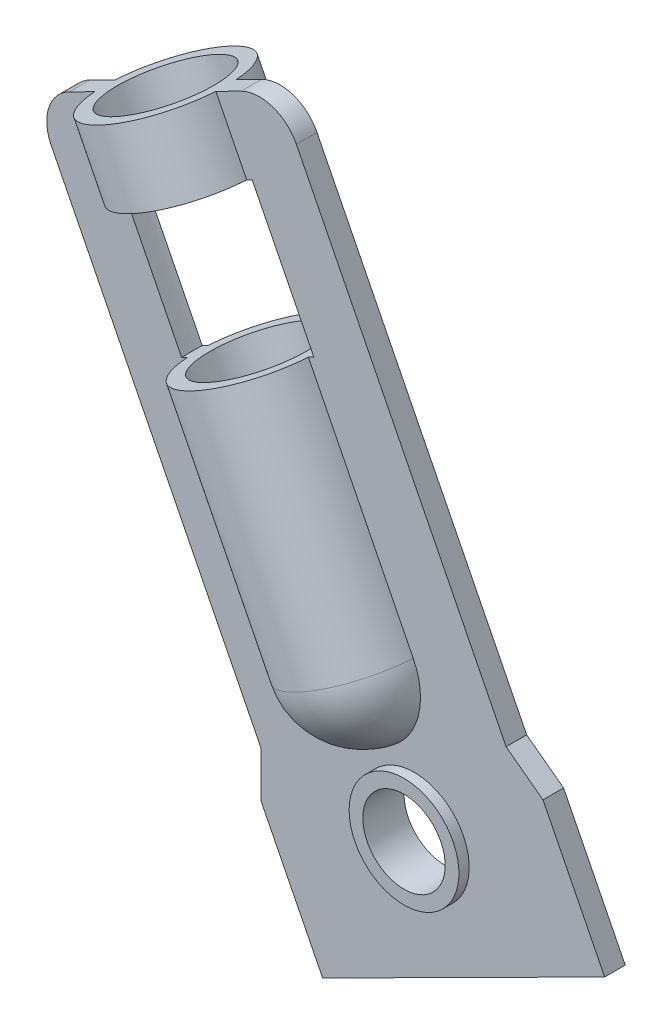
ISO-10303-21;
HEADER;
FILE_DESCRIPTION(('STEP AP214'),'2;1');
FILE_NAME('part.step','',(''),(''),'','','');
FILE_SCHEMA(('AUTOMOTIVE_DESIGN { 1 0 10303 214 1 1 1 1 }'));
ENDSEC;
DATA;
#1=APPLICATION_CONTEXT('core data for automotive mechanical design processes');
#2=APPLICATION_PROTOCOL_DEFINITION('international standard','automotive_design',2000,#1);
#3=PRODUCT_CONTEXT('',#1,'mechanical');
#4=PRODUCT('Part','Part','',(#3));
#5=PRODUCT_RELATED_PRODUCT_CATEGORY('part','',(#4));
#6=PRODUCT_DEFINITION_FORMATION('','',#4);
#7=PRODUCT_DEFINITION_CONTEXT('part definition',#1,'design');
#8=PRODUCT_DEFINITION('design','',#6,#7);
#9=PRODUCT_DEFINITION_SHAPE('','',#8);
#10=(LENGTH_UNIT() NAMED_UNIT(*) SI_UNIT(.MILLI.,.METRE.));
#11=(NAMED_UNIT(*) PLANE_ANGLE_UNIT() SI_UNIT($,.RADIAN.));
#12=(NAMED_UNIT(*) SI_UNIT($,.STERADIAN.) SOLID_ANGLE_UNIT());
#13=UNCERTAINTY_MEASURE_WITH_UNIT(LENGTH_MEASURE(1.E-05),#10,'distance_accuracy_value','');
#14=(GEOMETRIC_REPRESENTATION_CONTEXT(3) GLOBAL_UNCERTAINTY_ASSIGNED_CONTEXT((#13)) GLOBAL_UNIT_ASSIGNED_CONTEXT((#10,
#11,#12)) REPRESENTATION_CONTEXT('',''));
#15=CARTESIAN_POINT('',(0.,0.,0.));
#16=DIRECTION('',(0.,0.,1.));
#17=DIRECTION('',(1.,0.,0.));
#18=AXIS2_PLACEMENT_3D('',#15,#16,#17);
#19=CARTESIAN_POINT('',(18.8737568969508,39.4482201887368,18.5));
#20=DIRECTION('',(0.449375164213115,-0.893343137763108,0.));
#21=DIRECTION('',(0.893343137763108,0.449375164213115,0.));
#22=AXIS2_PLACEMENT_3D('',#19,#20,#21);
#23=CYLINDRICAL_SURFACE('',#22,5.);
#24=CARTESIAN_POINT('',(6.74062746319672,63.5684849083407,18.5));
#25=DIRECTION('',(0.449375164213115,-0.893343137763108,0.));
#26=DIRECTION('',(0.893343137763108,0.449375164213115,0.));
#27=AXIS2_PLACEMENT_3D('',#24,#25,#26);
#28=CIRCLE('',#27,5.);
#29=CARTESIAN_POINT('',(11.1568067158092,65.7899395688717,17.75));
#30=VERTEX_POINT('',#29);
#31=CARTESIAN_POINT('',(2.32444821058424,61.3470302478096,17.75));
#32=VERTEX_POINT('',#31);
#33=EDGE_CURVE('E718',#30,#32,#28,.F.);
#34=ORIENTED_EDGE('',*,*,#33,.F.);
#35=DIRECTION('',(0.449375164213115,-0.893343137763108,0.));
#36=VECTOR('',#35,1.);
#37=CARTESIAN_POINT('',(23.2899361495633,41.6696748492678,17.75));
#38=LINE('',#37,#36);
#39=CARTESIAN_POINT('',(18.7961845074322,50.6031062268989,17.75));
#40=VERTEX_POINT('',#39);
#41=EDGE_CURVE('E711',#30,#40,#38,.T.);
#42=ORIENTED_EDGE('',*,*,#41,.T.);
#43=CARTESIAN_POINT('',(14.3800052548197,48.3816515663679,18.5));
#44=DIRECTION('',(0.449375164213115,-0.893343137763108,0.));
#45=DIRECTION('',(0.893343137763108,0.449375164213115,0.));
#46=AXIS2_PLACEMENT_3D('',#43,#44,#45);
#47=CIRCLE('',#46,5.00000000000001);
#48=CARTESIAN_POINT('',(9.96382600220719,46.1601969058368,17.75));
#49=VERTEX_POINT('',#48);
#50=EDGE_CURVE('E726',#49,#40,#47,.T.);
#51=ORIENTED_EDGE('',*,*,#50,.F.);
#52=DIRECTION('',(0.449375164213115,-0.893343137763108,0.));
#53=VECTOR('',#52,1.);
#54=CARTESIAN_POINT('',(14.4575776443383,37.2267655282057,17.75));
#55=LINE('',#54,#53);
#56=EDGE_CURVE('E731',#49,#32,#55,.F.);
#57=ORIENTED_EDGE('',*,*,#56,.T.);
#58=EDGE_LOOP('',(#34,#42,#51,#57));
#59=FACE_BOUND('',#58,.T.);
#60=ADVANCED_FACE('F368',(#59),#23,.T.);
#61=CARTESIAN_POINT('',(6.74062746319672,63.5684849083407,18.5));
#62=DIRECTION('',(0.449375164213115,-0.893343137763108,0.));
#63=DIRECTION('',(0.893343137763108,0.449375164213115,0.));
#64=AXIS2_PLACEMENT_3D('',#61,#62,#63);
#65=CIRCLE('',#64,5.);
#66=CARTESIAN_POINT('',(2.32444821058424,61.3470302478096,19.25));
#67=VERTEX_POINT('',#66);
#68=CARTESIAN_POINT('',(11.1568067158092,65.7899395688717,19.25));
#69=VERTEX_POINT('',#68);
#70=EDGE_CURVE('E578',#67,#69,#65,.F.);
#71=ORIENTED_EDGE('',*,*,#70,.F.);
#72=DIRECTION('',(0.449375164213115,-0.893343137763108,0.));
#73=VECTOR('',#72,1.);
#74=CARTESIAN_POINT('',(14.4575776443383,37.2267655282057,19.25));
#75=LINE('',#74,#73);
#76=CARTESIAN_POINT('',(9.96382600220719,46.1601969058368,19.25));
#77=VERTEX_POINT('',#76);
#78=EDGE_CURVE('E592',#77,#67,#75,.F.);
#79=ORIENTED_EDGE('',*,*,#78,.F.);
#80=CARTESIAN_POINT('',(18.7961845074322,50.6031062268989,19.25));
#81=VERTEX_POINT('',#80);
#82=EDGE_CURVE('E727',#81,#77,#47,.T.);
#83=ORIENTED_EDGE('',*,*,#82,.F.);
#84=DIRECTION('',(0.449375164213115,-0.893343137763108,0.));
#85=VECTOR('',#84,1.);
#86=CARTESIAN_POINT('',(23.2899361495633,41.6696748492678,19.25));
#87=LINE('',#86,#85);
#88=EDGE_CURVE('E588',#69,#81,#87,.T.);
#89=ORIENTED_EDGE('',*,*,#88,.F.);
#90=EDGE_LOOP('',(#71,#79,#83,#89));
#91=FACE_BOUND('',#90,.T.);
#92=ADVANCED_FACE('F531',(#91),#23,.T.);
#93=CARTESIAN_POINT('',(-4.90527647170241,71.1429764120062,19.25));
#94=DIRECTION('',(0.,0.,-1.));
#95=DIRECTION('',(-1.,0.,0.));
#96=AXIS2_PLACEMENT_3D('',#93,#94,#95);
#97=PLANE('',#96);
#98=ORIENTED_EDGE('',*,*,#78,.T.);
#99=DIRECTION('',(-0.893343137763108,-0.449375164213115,0.));
#100=VECTOR('',#99,1.);
#101=CARTESIAN_POINT('',(0.487225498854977,60.4228587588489,19.25));
#102=LINE('',#101,#100);
#103=CARTESIAN_POINT('',(1.92415486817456,61.1456721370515,19.25));
#104=VERTEX_POINT('',#103);
#105=EDGE_CURVE('E756',#67,#104,#102,.T.);
#106=ORIENTED_EDGE('',*,*,#105,.T.);
#107=DIRECTION('',(0.449375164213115,-0.893343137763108,0.));
#108=VECTOR('',#107,1.);
#109=CARTESIAN_POINT('',(14.0572843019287,37.0254074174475,19.25));
#110=LINE('',#109,#108);
#111=CARTESIAN_POINT('',(-2.56959677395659,70.0791035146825,19.25));
#112=VERTEX_POINT('',#111);
#113=EDGE_CURVE('E712',#104,#112,#110,.F.);
#114=ORIENTED_EDGE('',*,*,#113,.T.);
#115=DIRECTION('',(0.893343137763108,0.449375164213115,0.));
#116=VECTOR('',#115,1.);
#117=CARTESIAN_POINT('',(-4.00652614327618,69.35629013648,19.25));
#118=LINE('',#117,#116);
#119=CARTESIAN_POINT('',(-2.16930343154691,70.2804616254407,19.25));
#120=VERTEX_POINT('',#119);
#121=EDGE_CURVE('E752',#112,#120,#118,.T.);
#122=ORIENTED_EDGE('',*,*,#121,.T.);
#123=CARTESIAN_POINT('',(-4.41617925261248,74.7471773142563,19.25));
#124=VERTEX_POINT('',#123);
#125=EDGE_CURVE('E576',#120,#124,#75,.F.);
#126=ORIENTED_EDGE('',*,*,#125,.T.);
#127=DIRECTION('',(-0.893343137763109,-0.449375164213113,0.));
#128=VECTOR('',#127,1.);
#129=CARTESIAN_POINT('',(-6.25340196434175,73.8230058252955,19.25));
#130=LINE('',#129,#128);
#131=CARTESIAN_POINT('',(-6.25340196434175,73.8230058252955,19.25));
#132=VERTEX_POINT('',#131);
#133=EDGE_CURVE('E642',#124,#132,#130,.T.);
#134=ORIENTED_EDGE('',*,*,#133,.T.);
#135=CARTESIAN_POINT('',(-4.90527647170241,71.1429764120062,19.25));
#136=DIRECTION('',(0.,0.,1.));
#137=DIRECTION('',(-1.,0.,0.));
#138=AXIS2_PLACEMENT_3D('',#135,#136,#137);
#139=CIRCLE('',#138,3.);
#140=CARTESIAN_POINT('',(-7.58530588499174,69.7948509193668,19.25));
#141=VERTEX_POINT('',#140);
#142=EDGE_CURVE('E644',#132,#141,#139,.T.);
#143=ORIENTED_EDGE('',*,*,#142,.T.);
#144=DIRECTION('',(0.449375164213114,-0.893343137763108,0.));
#145=VECTOR('',#144,1.);
#146=CARTESIAN_POINT('',(-7.58530588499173,69.7948509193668,19.25));
#147=LINE('',#146,#145);
#148=CARTESIAN_POINT('',(7.69344969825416,39.4211842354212,19.25));
#149=VERTEX_POINT('',#148);
#150=EDGE_CURVE('E646',#141,#149,#147,.T.);
#151=ORIENTED_EDGE('',*,*,#150,.T.);
#152=DIRECTION('',(0.00241816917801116,-0.999997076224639,0.));
#153=VECTOR('',#152,1.);
#154=CARTESIAN_POINT('',(7.69344969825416,39.4211842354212,19.25));
#155=LINE('',#154,#153);
#156=CARTESIAN_POINT('',(7.70156048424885,36.0670920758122,19.25));
#157=VERTEX_POINT('',#156);
#158=EDGE_CURVE('E648',#149,#157,#155,.T.);
#159=ORIENTED_EDGE('',*,*,#158,.T.);
#160=DIRECTION('',(0.449375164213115,-0.893343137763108,0.));
#161=VECTOR('',#160,1.);
#162=CARTESIAN_POINT('',(7.70156048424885,36.0670920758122,19.25));
#163=LINE('',#162,#161);
#164=CARTESIAN_POINT('',(12.19531212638,27.1336606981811,19.25));
#165=VERTEX_POINT('',#164);
#166=EDGE_CURVE('E650',#157,#165,#163,.T.);
#167=ORIENTED_EDGE('',*,*,#166,.T.);
#168=DIRECTION('',(0.893343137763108,0.449375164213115,0.));
#169=VECTOR('',#168,1.);
#170=CARTESIAN_POINT('',(32.7422042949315,37.4692894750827,19.25));
#171=LINE('',#170,#169);
#172=CARTESIAN_POINT('',(32.7422042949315,37.4692894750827,19.25));
#173=VERTEX_POINT('',#172);
#174=EDGE_CURVE('E652',#165,#173,#171,.T.);
#175=ORIENTED_EDGE('',*,*,#174,.T.);
#176=DIRECTION('',(-0.449375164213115,0.893343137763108,0.));
#177=VECTOR('',#176,1.);
#178=CARTESIAN_POINT('',(28.2484526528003,46.4027208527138,19.25));
#179=LINE('',#178,#177);
#180=CARTESIAN_POINT('',(28.2484526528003,46.4027208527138,19.25));
#181=VERTEX_POINT('',#180);
#182=EDGE_CURVE('E654',#173,#181,#179,.T.);
#183=ORIENTED_EDGE('',*,*,#182,.T.);
#184=DIRECTION('',(-0.801448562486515,0.598063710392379,0.));
#185=VECTOR('',#184,1.);
#186=CARTESIAN_POINT('',(25.5603124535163,48.4086875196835,19.25));
#187=LINE('',#186,#185);
#188=CARTESIAN_POINT('',(25.5603124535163,48.4086875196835,19.25));
#189=VERTEX_POINT('',#188);
#190=EDGE_CURVE('E635',#181,#189,#187,.T.);
#191=ORIENTED_EDGE('',*,*,#190,.T.);
#192=DIRECTION('',(-0.449375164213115,0.893343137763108,0.));
#193=VECTOR('',#192,1.);
#194=CARTESIAN_POINT('',(10.2815568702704,78.7823542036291,19.25));
#195=LINE('',#194,#193);
#196=CARTESIAN_POINT('',(10.2815568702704,78.7823542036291,19.25));
#197=VERTEX_POINT('',#196);
#198=EDGE_CURVE('E638',#189,#197,#195,.T.);
#199=ORIENTED_EDGE('',*,*,#198,.T.);
#200=CARTESIAN_POINT('',(7.6015274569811,77.4342287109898,19.25));
#201=DIRECTION('',(0.,0.,1.));
#202=DIRECTION('',(1.,0.,0.));
#203=AXIS2_PLACEMENT_3D('',#200,#201,#202);
#204=CIRCLE('',#203,3.);
#205=CARTESIAN_POINT('',(6.25340196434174,80.1142581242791,19.25));
#206=VERTEX_POINT('',#205);
#207=EDGE_CURVE('E640',#197,#206,#204,.T.);
#208=ORIENTED_EDGE('',*,*,#207,.T.);
#209=CARTESIAN_POINT('',(4.41617925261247,79.1900866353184,19.25));
#210=VERTEX_POINT('',#209);
#211=EDGE_CURVE('E586',#206,#210,#130,.T.);
#212=ORIENTED_EDGE('',*,*,#211,.T.);
#213=CARTESIAN_POINT('',(6.66305507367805,74.7233709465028,19.25));
#214=VERTEX_POINT('',#213);
#215=EDGE_CURVE('E574',#210,#214,#87,.T.);
#216=ORIENTED_EDGE('',*,*,#215,.T.);
#217=CARTESIAN_POINT('',(7.06334841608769,74.924729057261,19.25));
#218=VERTEX_POINT('',#217);
#219=EDGE_CURVE('E390',#214,#218,#118,.T.);
#220=ORIENTED_EDGE('',*,*,#219,.T.);
#221=DIRECTION('',(0.449375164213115,-0.893343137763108,0.));
#222=VECTOR('',#221,1.);
#223=CARTESIAN_POINT('',(23.690229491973,41.871032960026,19.25));
#224=LINE('',#223,#222);
#225=CARTESIAN_POINT('',(11.5571000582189,65.9912976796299,19.25));
#226=VERTEX_POINT('',#225);
#227=EDGE_CURVE('E716',#218,#226,#224,.T.);
#228=ORIENTED_EDGE('',*,*,#227,.T.);
#229=EDGE_CURVE('E702',#226,#69,#102,.T.);
#230=ORIENTED_EDGE('',*,*,#229,.T.);
#231=ORIENTED_EDGE('',*,*,#88,.T.);
#232=CARTESIAN_POINT('',(14.3800052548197,48.3816515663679,19.25));
#233=DIRECTION('',(0.,0.,-1.));
#234=DIRECTION('',(-1.,0.,0.));
#235=AXIS2_PLACEMENT_3D('',#232,#233,#234);
#236=CIRCLE('',#235,4.94342998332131);
#237=EDGE_CURVE('E587',#81,#77,#236,.T.);
#238=ORIENTED_EDGE('',*,*,#237,.T.);
#239=EDGE_LOOP('',(#98,#106,#114,#122,#126,#134,#143,#151,#159,#167,#175,#183,#191,#199,#208,
#212,#216,#220,#228,#230,#231,#238));
#240=FACE_BOUND('',#239,.T.);
#241=CARTESIAN_POINT('',(18.8737568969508,39.4482201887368,19.25));
#242=DIRECTION('',(0.,0.,-1.));
#243=DIRECTION('',(-1.,0.,0.));
#244=AXIS2_PLACEMENT_3D('',#241,#242,#243);
#245=CIRCLE('',#244,4.);
#246=CARTESIAN_POINT('',(14.8737568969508,39.4482201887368,19.25));
#247=VERTEX_POINT('',#246);
#248=EDGE_CURVE('E608',#247,#247,#245,.F.);
#249=ORIENTED_EDGE('',*,*,#248,.F.);
#250=EDGE_LOOP('',(#249));
#251=FACE_BOUND('',#250,.T.);
#252=ADVANCED_FACE('F539',(#240,#251),#97,.F.);
#253=CARTESIAN_POINT('',(-4.90527647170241,71.1429764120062,17.75));
#254=DIRECTION('',(0.,0.,-1.));
#255=DIRECTION('',(-1.,0.,0.));
#256=AXIS2_PLACEMENT_3D('',#253,#254,#255);
#257=PLANE('',#256);
#258=DIRECTION('',(-0.893343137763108,-0.449375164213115,0.));
#259=VECTOR('',#258,1.);
#260=CARTESIAN_POINT('',(0.487225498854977,60.4228587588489,17.75));
#261=LINE('',#260,#259);
#262=CARTESIAN_POINT('',(1.92415486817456,61.1456721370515,17.75));
#263=VERTEX_POINT('',#262);
#264=EDGE_CURVE('E713',#32,#263,#261,.T.);
#265=ORIENTED_EDGE('',*,*,#264,.F.);
#266=ORIENTED_EDGE('',*,*,#56,.F.);
#267=CARTESIAN_POINT('',(14.3800052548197,48.3816515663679,17.75));
#268=DIRECTION('',(0.,0.,-1.));
#269=DIRECTION('',(-1.,0.,0.));
#270=AXIS2_PLACEMENT_3D('',#267,#268,#269);
#271=CIRCLE('',#270,4.94342998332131);
#272=EDGE_CURVE('E579',#40,#49,#271,.T.);
#273=ORIENTED_EDGE('',*,*,#272,.F.);
#274=ORIENTED_EDGE('',*,*,#41,.F.);
#275=CARTESIAN_POINT('',(11.5571000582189,65.9912976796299,17.75));
#276=VERTEX_POINT('',#275);
#277=EDGE_CURVE('E700',#276,#30,#261,.T.);
#278=ORIENTED_EDGE('',*,*,#277,.F.);
#279=DIRECTION('',(0.449375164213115,-0.893343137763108,0.));
#280=VECTOR('',#279,1.);
#281=CARTESIAN_POINT('',(23.690229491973,41.871032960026,17.75));
#282=LINE('',#281,#280);
#283=CARTESIAN_POINT('',(7.06334841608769,74.924729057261,17.75));
#284=VERTEX_POINT('',#283);
#285=EDGE_CURVE('E376',#284,#276,#282,.T.);
#286=ORIENTED_EDGE('',*,*,#285,.F.);
#287=DIRECTION('',(0.893343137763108,0.449375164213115,0.));
#288=VECTOR('',#287,1.);
#289=CARTESIAN_POINT('',(-4.00652614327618,69.35629013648,17.75));
#290=LINE('',#289,#288);
#291=CARTESIAN_POINT('',(6.66305507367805,74.7233709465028,17.75));
#292=VERTEX_POINT('',#291);
#293=EDGE_CURVE('E755',#292,#284,#290,.T.);
#294=ORIENTED_EDGE('',*,*,#293,.F.);
#295=CARTESIAN_POINT('',(4.41617925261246,79.1900866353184,17.75));
#296=VERTEX_POINT('',#295);
#297=EDGE_CURVE('E733',#296,#292,#38,.T.);
#298=ORIENTED_EDGE('',*,*,#297,.F.);
#299=DIRECTION('',(-0.893343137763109,-0.449375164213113,0.));
#300=VECTOR('',#299,1.);
#301=CARTESIAN_POINT('',(-6.25340196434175,73.8230058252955,17.75));
#302=LINE('',#301,#300);
#303=CARTESIAN_POINT('',(6.25340196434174,80.1142581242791,17.75));
#304=VERTEX_POINT('',#303);
#305=EDGE_CURVE('E620',#304,#296,#302,.T.);
#306=ORIENTED_EDGE('',*,*,#305,.F.);
#307=CARTESIAN_POINT('',(7.6015274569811,77.4342287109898,17.75));
#308=DIRECTION('',(0.,0.,1.));
#309=DIRECTION('',(1.,0.,0.));
#310=AXIS2_PLACEMENT_3D('',#307,#308,#309);
#311=CIRCLE('',#310,3.);
#312=CARTESIAN_POINT('',(10.2815568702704,78.7823542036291,17.75));
#313=VERTEX_POINT('',#312);
#314=EDGE_CURVE('E617',#313,#304,#311,.T.);
#315=ORIENTED_EDGE('',*,*,#314,.F.);
#316=DIRECTION('',(-0.449375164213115,0.893343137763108,0.));
#317=VECTOR('',#316,1.);
#318=CARTESIAN_POINT('',(10.2815568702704,78.7823542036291,17.75));
#319=LINE('',#318,#317);
#320=CARTESIAN_POINT('',(25.5603124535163,48.4086875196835,17.75));
#321=VERTEX_POINT('',#320);
#322=EDGE_CURVE('E615',#321,#313,#319,.T.);
#323=ORIENTED_EDGE('',*,*,#322,.F.);
#324=DIRECTION('',(-0.801448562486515,0.598063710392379,0.));
#325=VECTOR('',#324,1.);
#326=CARTESIAN_POINT('',(25.5603124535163,48.4086875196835,17.75));
#327=LINE('',#326,#325);
#328=CARTESIAN_POINT('',(28.2484526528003,46.4027208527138,17.75));
#329=VERTEX_POINT('',#328);
#330=EDGE_CURVE('E612',#329,#321,#327,.T.);
#331=ORIENTED_EDGE('',*,*,#330,.F.);
#332=DIRECTION('',(-0.449375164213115,0.893343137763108,0.));
#333=VECTOR('',#332,1.);
#334=CARTESIAN_POINT('',(28.2484526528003,46.4027208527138,17.75));
#335=LINE('',#334,#333);
#336=CARTESIAN_POINT('',(32.7422042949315,37.4692894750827,17.75));
#337=VERTEX_POINT('',#336);
#338=EDGE_CURVE('E633',#337,#329,#335,.T.);
#339=ORIENTED_EDGE('',*,*,#338,.F.);
#340=DIRECTION('',(0.893343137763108,0.449375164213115,0.));
#341=VECTOR('',#340,1.);
#342=CARTESIAN_POINT('',(32.7422042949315,37.4692894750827,17.75));
#343=LINE('',#342,#341);
#344=CARTESIAN_POINT('',(12.19531212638,27.1336606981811,17.75));
#345=VERTEX_POINT('',#344);
#346=EDGE_CURVE('E631',#345,#337,#343,.T.);
#347=ORIENTED_EDGE('',*,*,#346,.F.);
#348=DIRECTION('',(0.449375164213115,-0.893343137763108,0.));
#349=VECTOR('',#348,1.);
#350=CARTESIAN_POINT('',(7.70156048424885,36.0670920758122,17.75));
#351=LINE('',#350,#349);
#352=CARTESIAN_POINT('',(7.70156048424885,36.0670920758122,17.75));
#353=VERTEX_POINT('',#352);
#354=EDGE_CURVE('E629',#353,#345,#351,.T.);
#355=ORIENTED_EDGE('',*,*,#354,.F.);
#356=DIRECTION('',(0.00241816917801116,-0.999997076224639,0.));
#357=VECTOR('',#356,1.);
#358=CARTESIAN_POINT('',(7.69344969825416,39.4211842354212,17.75));
#359=LINE('',#358,#357);
#360=CARTESIAN_POINT('',(7.69344969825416,39.4211842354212,17.75));
#361=VERTEX_POINT('',#360);
#362=EDGE_CURVE('E627',#361,#353,#359,.T.);
#363=ORIENTED_EDGE('',*,*,#362,.F.);
#364=DIRECTION('',(0.449375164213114,-0.893343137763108,0.));
#365=VECTOR('',#364,1.);
#366=CARTESIAN_POINT('',(-7.58530588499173,69.7948509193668,17.75));
#367=LINE('',#366,#365);
#368=CARTESIAN_POINT('',(-7.58530588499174,69.7948509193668,17.75));
#369=VERTEX_POINT('',#368);
#370=EDGE_CURVE('E625',#369,#361,#367,.T.);
#371=ORIENTED_EDGE('',*,*,#370,.F.);
#372=CARTESIAN_POINT('',(-4.90527647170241,71.1429764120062,17.75));
#373=DIRECTION('',(0.,0.,1.));
#374=DIRECTION('',(-1.,0.,0.));
#375=AXIS2_PLACEMENT_3D('',#372,#373,#374);
#376=CIRCLE('',#375,3.);
#377=CARTESIAN_POINT('',(-6.25340196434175,73.8230058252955,17.75));
#378=VERTEX_POINT('',#377);
#379=EDGE_CURVE('E623',#378,#369,#376,.T.);
#380=ORIENTED_EDGE('',*,*,#379,.F.);
#381=CARTESIAN_POINT('',(-4.4161792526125,74.7471773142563,17.75));
#382=VERTEX_POINT('',#381);
#383=EDGE_CURVE('E619',#382,#378,#302,.T.);
#384=ORIENTED_EDGE('',*,*,#383,.F.);
#385=CARTESIAN_POINT('',(-2.16930343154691,70.2804616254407,17.75));
#386=VERTEX_POINT('',#385);
#387=EDGE_CURVE('E730',#386,#382,#55,.F.);
#388=ORIENTED_EDGE('',*,*,#387,.F.);
#389=CARTESIAN_POINT('',(-2.56959677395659,70.0791035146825,17.75));
#390=VERTEX_POINT('',#389);
#391=EDGE_CURVE('E383',#390,#386,#290,.T.);
#392=ORIENTED_EDGE('',*,*,#391,.F.);
#393=DIRECTION('',(0.449375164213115,-0.893343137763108,0.));
#394=VECTOR('',#393,1.);
#395=CARTESIAN_POINT('',(14.0572843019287,37.0254074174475,17.75));
#396=LINE('',#395,#394);
#397=EDGE_CURVE('E11',#263,#390,#396,.F.);
#398=ORIENTED_EDGE('',*,*,#397,.F.);
#399=EDGE_LOOP('',(#265,#266,#273,#274,#278,#286,#294,#298,#306,#315,#323,#331,#339,#347,#355,
#363,#371,#380,#384,#388,#392,#398));
#400=FACE_BOUND('',#399,.T.);
#401=CARTESIAN_POINT('',(18.8737568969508,39.4482201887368,17.75));
#402=DIRECTION('',(0.,0.,-1.));
#403=DIRECTION('',(-1.,0.,0.));
#404=AXIS2_PLACEMENT_3D('',#401,#402,#403);
#405=CIRCLE('',#404,4.);
#406=CARTESIAN_POINT('',(14.8737568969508,39.4482201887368,17.75));
#407=VERTEX_POINT('',#406);
#408=EDGE_CURVE('E607',#407,#407,#405,.F.);
#409=ORIENTED_EDGE('',*,*,#408,.T.);
#410=EDGE_LOOP('',(#409));
#411=FACE_BOUND('',#410,.T.);
#412=ADVANCED_FACE('F708',(#400,#411),#257,.T.);
#413=CARTESIAN_POINT('',(25.5603124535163,48.4086875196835,19.25));
#414=DIRECTION('',(-0.598063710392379,-0.801448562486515,0.));
#415=DIRECTION('',(0.801448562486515,-0.598063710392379,0.));
#416=AXIS2_PLACEMENT_3D('',#413,#414,#415);
#417=PLANE('',#416);
#418=ORIENTED_EDGE('',*,*,#330,.T.);
#419=DIRECTION('',(0.,0.,-1.));
#420=VECTOR('',#419,1.);
#421=CARTESIAN_POINT('',(25.5603124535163,48.4086875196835,19.25));
#422=LINE('',#421,#420);
#423=EDGE_CURVE('E611',#189,#321,#422,.T.);
#424=ORIENTED_EDGE('',*,*,#423,.F.);
#425=ORIENTED_EDGE('',*,*,#190,.F.);
#426=DIRECTION('',(0.,0.,-1.));
#427=VECTOR('',#426,1.);
#428=CARTESIAN_POINT('',(28.2484526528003,46.4027208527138,19.25));
#429=LINE('',#428,#427);
#430=EDGE_CURVE('E656',#181,#329,#429,.T.);
#431=ORIENTED_EDGE('',*,*,#430,.T.);
#432=EDGE_LOOP('',(#418,#424,#425,#431));
#433=FACE_BOUND('',#432,.T.);
#434=ADVANCED_FACE('F370',(#433),#417,.F.);
#435=CARTESIAN_POINT('',(10.2815568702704,78.7823542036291,19.25));
#436=DIRECTION('',(-0.893343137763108,-0.449375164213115,0.));
#437=DIRECTION('',(0.449375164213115,-0.893343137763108,0.));
#438=AXIS2_PLACEMENT_3D('',#435,#436,#437);
#439=PLANE('',#438);
#440=ORIENTED_EDGE('',*,*,#322,.T.);
#441=DIRECTION('',(0.,0.,-1.));
#442=VECTOR('',#441,1.);
#443=CARTESIAN_POINT('',(10.2815568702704,78.7823542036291,19.25));
#444=LINE('',#443,#442);
#445=EDGE_CURVE('E680',#197,#313,#444,.T.);
#446=ORIENTED_EDGE('',*,*,#445,.F.);
#447=ORIENTED_EDGE('',*,*,#198,.F.);
#448=ORIENTED_EDGE('',*,*,#423,.T.);
#449=EDGE_LOOP('',(#440,#446,#447,#448));
#450=FACE_BOUND('',#449,.T.);
#451=ADVANCED_FACE('F880',(#450),#439,.F.);
#452=CARTESIAN_POINT('',(7.6015274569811,77.4342287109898,19.25));
#453=DIRECTION('',(0.,0.,-1.));
#454=DIRECTION('',(-1.,0.,0.));
#455=AXIS2_PLACEMENT_3D('',#452,#453,#454);
#456=CYLINDRICAL_SURFACE('',#455,3.);
#457=ORIENTED_EDGE('',*,*,#314,.T.);
#458=DIRECTION('',(0.,0.,-1.));
#459=VECTOR('',#458,1.);
#460=CARTESIAN_POINT('',(6.25340196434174,80.1142581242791,19.25));
#461=LINE('',#460,#459);
#462=EDGE_CURVE('E677',#206,#304,#461,.T.);
#463=ORIENTED_EDGE('',*,*,#462,.F.);
#464=ORIENTED_EDGE('',*,*,#207,.F.);
#465=ORIENTED_EDGE('',*,*,#445,.T.);
#466=EDGE_LOOP('',(#457,#463,#464,#465));
#467=FACE_BOUND('',#466,.T.);
#468=ADVANCED_FACE('F821',(#467),#456,.T.);
#469=CARTESIAN_POINT('',(-6.25340196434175,73.8230058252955,19.25));
#470=DIRECTION('',(0.449375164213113,-0.893343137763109,0.));
#471=DIRECTION('',(0.893343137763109,0.449375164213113,0.));
#472=AXIS2_PLACEMENT_3D('',#469,#470,#471);
#473=PLANE('',#472);
#474=CARTESIAN_POINT('',(0.,76.9686319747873,18.5));
#475=DIRECTION('',(0.449375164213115,-0.893343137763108,0.));
#476=DIRECTION('',(0.893343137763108,0.449375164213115,0.));
#477=AXIS2_PLACEMENT_3D('',#474,#475,#476);
#478=CIRCLE('',#477,3.94342998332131);
#479=CARTESIAN_POINT('',(3.52283611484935,78.7407114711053,18.5));
#480=VERTEX_POINT('',#479);
#481=EDGE_CURVE('E766',#480,#480,#478,.T.);
#482=ORIENTED_EDGE('',*,*,#481,.T.);
#483=EDGE_LOOP('',(#482));
#484=FACE_BOUND('',#483,.T.);
#485=ORIENTED_EDGE('',*,*,#305,.T.);
#486=CARTESIAN_POINT('',(0.,76.9686319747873,18.5));
#487=DIRECTION('',(0.449375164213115,-0.893343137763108,0.));
#488=DIRECTION('',(0.893343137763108,0.449375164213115,0.));
#489=AXIS2_PLACEMENT_3D('',#486,#487,#488);
#490=CIRCLE('',#489,4.99999999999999);
#491=EDGE_CURVE('E723',#382,#296,#490,.T.);
#492=ORIENTED_EDGE('',*,*,#491,.F.);
#493=ORIENTED_EDGE('',*,*,#383,.T.);
#494=DIRECTION('',(0.,0.,-1.));
#495=VECTOR('',#494,1.);
#496=CARTESIAN_POINT('',(-6.25340196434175,73.8230058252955,19.25));
#497=LINE('',#496,#495);
#498=EDGE_CURVE('E674',#132,#378,#497,.T.);
#499=ORIENTED_EDGE('',*,*,#498,.F.);
#500=ORIENTED_EDGE('',*,*,#133,.F.);
#501=EDGE_CURVE('E724',#210,#124,#490,.T.);
#502=ORIENTED_EDGE('',*,*,#501,.F.);
#503=ORIENTED_EDGE('',*,*,#211,.F.);
#504=ORIENTED_EDGE('',*,*,#462,.T.);
#505=EDGE_LOOP('',(#485,#492,#493,#499,#500,#502,#503,#504));
#506=FACE_BOUND('',#505,.T.);
#507=ADVANCED_FACE('F815',(#484,#506),#473,.F.);
#508=CARTESIAN_POINT('',(-4.90527647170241,71.1429764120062,19.25));
#509=DIRECTION('',(0.,0.,-1.));
#510=DIRECTION('',(-1.,0.,0.));
#511=AXIS2_PLACEMENT_3D('',#508,#509,#510);
#512=CYLINDRICAL_SURFACE('',#511,3.);
#513=ORIENTED_EDGE('',*,*,#379,.T.);
#514=DIRECTION('',(0.,0.,-1.));
#515=VECTOR('',#514,1.);
#516=CARTESIAN_POINT('',(-7.58530588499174,69.7948509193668,19.25));
#517=LINE('',#516,#515);
#518=EDGE_CURVE('E671',#141,#369,#517,.T.);
#519=ORIENTED_EDGE('',*,*,#518,.F.);
#520=ORIENTED_EDGE('',*,*,#142,.F.);
#521=ORIENTED_EDGE('',*,*,#498,.T.);
#522=EDGE_LOOP('',(#513,#519,#520,#521));
#523=FACE_BOUND('',#522,.T.);
#524=ADVANCED_FACE('F820',(#523),#512,.T.);
#525=CARTESIAN_POINT('',(-7.58530588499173,69.7948509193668,19.25));
#526=DIRECTION('',(0.893343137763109,0.449375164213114,0.));
#527=DIRECTION('',(-0.449375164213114,0.893343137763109,0.));
#528=AXIS2_PLACEMENT_3D('',#525,#526,#527);
#529=PLANE('',#528);
#530=ORIENTED_EDGE('',*,*,#370,.T.);
#531=DIRECTION('',(0.,0.,-1.));
#532=VECTOR('',#531,1.);
#533=CARTESIAN_POINT('',(7.69344969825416,39.4211842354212,19.25));
#534=LINE('',#533,#532);
#535=EDGE_CURVE('E668',#149,#361,#534,.T.);
#536=ORIENTED_EDGE('',*,*,#535,.F.);
#537=ORIENTED_EDGE('',*,*,#150,.F.);
#538=ORIENTED_EDGE('',*,*,#518,.T.);
#539=EDGE_LOOP('',(#530,#536,#537,#538));
#540=FACE_BOUND('',#539,.T.);
#541=ADVANCED_FACE('F896',(#540),#529,.F.);
#542=CARTESIAN_POINT('',(7.69344969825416,39.4211842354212,19.25));
#543=DIRECTION('',(0.999997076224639,0.00241816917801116,0.));
#544=DIRECTION('',(-0.00241816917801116,0.999997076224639,0.));
#545=AXIS2_PLACEMENT_3D('',#542,#543,#544);
#546=PLANE('',#545);
#547=ORIENTED_EDGE('',*,*,#362,.T.);
#548=DIRECTION('',(0.,0.,-1.));
#549=VECTOR('',#548,1.);
#550=CARTESIAN_POINT('',(7.70156048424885,36.0670920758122,19.25));
#551=LINE('',#550,#549);
#552=EDGE_CURVE('E665',#157,#353,#551,.T.);
#553=ORIENTED_EDGE('',*,*,#552,.F.);
#554=ORIENTED_EDGE('',*,*,#158,.F.);
#555=ORIENTED_EDGE('',*,*,#535,.T.);
#556=EDGE_LOOP('',(#547,#553,#554,#555));
#557=FACE_BOUND('',#556,.T.);
#558=ADVANCED_FACE('F892',(#557),#546,.F.);
#559=CARTESIAN_POINT('',(7.70156048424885,36.0670920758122,19.25));
#560=DIRECTION('',(0.893343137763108,0.449375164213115,0.));
#561=DIRECTION('',(-0.449375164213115,0.893343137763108,0.));
#562=AXIS2_PLACEMENT_3D('',#559,#560,#561);
#563=PLANE('',#562);
#564=ORIENTED_EDGE('',*,*,#354,.T.);
#565=DIRECTION('',(0.,0.,-1.));
#566=VECTOR('',#565,1.);
#567=CARTESIAN_POINT('',(12.19531212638,27.1336606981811,19.25));
#568=LINE('',#567,#566);
#569=EDGE_CURVE('E662',#165,#345,#568,.T.);
#570=ORIENTED_EDGE('',*,*,#569,.F.);
#571=ORIENTED_EDGE('',*,*,#166,.F.);
#572=ORIENTED_EDGE('',*,*,#552,.T.);
#573=EDGE_LOOP('',(#564,#570,#571,#572));
#574=FACE_BOUND('',#573,.T.);
#575=ADVANCED_FACE('F888',(#574),#563,.F.);
#576=CARTESIAN_POINT('',(32.7422042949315,37.4692894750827,19.25));
#577=DIRECTION('',(-0.449375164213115,0.893343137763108,0.));
#578=DIRECTION('',(-0.893343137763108,-0.449375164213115,0.));
#579=AXIS2_PLACEMENT_3D('',#576,#577,#578);
#580=PLANE('',#579);
#581=ORIENTED_EDGE('',*,*,#346,.T.);
#582=DIRECTION('',(0.,0.,-1.));
#583=VECTOR('',#582,1.);
#584=CARTESIAN_POINT('',(32.7422042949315,37.4692894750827,19.25));
#585=LINE('',#584,#583);
#586=EDGE_CURVE('E659',#173,#337,#585,.T.);
#587=ORIENTED_EDGE('',*,*,#586,.F.);
#588=ORIENTED_EDGE('',*,*,#174,.F.);
#589=ORIENTED_EDGE('',*,*,#569,.T.);
#590=EDGE_LOOP('',(#581,#587,#588,#589));
#591=FACE_BOUND('',#590,.T.);
#592=ADVANCED_FACE('F884',(#591),#580,.F.);
#593=CARTESIAN_POINT('',(28.2484526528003,46.4027208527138,19.25));
#594=DIRECTION('',(-0.893343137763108,-0.449375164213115,0.));
#595=DIRECTION('',(0.449375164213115,-0.893343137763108,0.));
#596=AXIS2_PLACEMENT_3D('',#593,#594,#595);
#597=PLANE('',#596);
#598=ORIENTED_EDGE('',*,*,#338,.T.);
#599=ORIENTED_EDGE('',*,*,#430,.F.);
#600=ORIENTED_EDGE('',*,*,#182,.F.);
#601=ORIENTED_EDGE('',*,*,#586,.T.);
#602=EDGE_LOOP('',(#598,#599,#600,#601));
#603=FACE_BOUND('',#602,.T.);
#604=ADVANCED_FACE('F867',(#603),#597,.F.);
#605=CARTESIAN_POINT('',(18.8737568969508,39.4482201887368,31.3137084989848));
#606=DIRECTION('',(0.,0.,-1.));
#607=DIRECTION('',(-1.,0.,0.));
#608=AXIS2_PLACEMENT_3D('',#605,#606,#607);
#609=CYLINDRICAL_SURFACE('',#608,4.);
#610=ORIENTED_EDGE('',*,*,#408,.F.);
#611=EDGE_LOOP('',(#610));
#612=FACE_BOUND('',#611,.T.);
#613=CARTESIAN_POINT('',(18.8737568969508,39.4482201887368,17.));
#614=DIRECTION('',(0.,0.,-1.));
#615=DIRECTION('',(-1.,0.,0.));
#616=AXIS2_PLACEMENT_3D('',#613,#614,#615);
#617=CIRCLE('',#616,4.);
#618=CARTESIAN_POINT('',(14.8737568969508,39.4482201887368,17.));
#619=VERTEX_POINT('',#618);
#620=EDGE_CURVE('E590',#619,#619,#617,.T.);
#621=ORIENTED_EDGE('',*,*,#620,.F.);
#622=EDGE_LOOP('',(#621));
#623=FACE_BOUND('',#622,.T.);
#624=ADVANCED_FACE('F841',(#612,#623),#609,.T.);
#625=CARTESIAN_POINT('',(22.8737568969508,39.4482201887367,17.));
#626=DIRECTION('',(0.,0.,-1.));
#627=DIRECTION('',(-1.,0.,0.));
#628=AXIS2_PLACEMENT_3D('',#625,#626,#627);
#629=PLANE('',#628);
#630=ORIENTED_EDGE('',*,*,#620,.T.);
#631=EDGE_LOOP('',(#630));
#632=FACE_BOUND('',#631,.T.);
#633=CARTESIAN_POINT('',(18.8737568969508,39.4482201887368,17.));
#634=DIRECTION('',(0.,0.,-1.));
#635=DIRECTION('',(-1.,0.,0.));
#636=AXIS2_PLACEMENT_3D('',#633,#634,#635);
#637=CIRCLE('',#636,3.);
#638=CARTESIAN_POINT('',(15.8737568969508,39.4482201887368,17.));
#639=VERTEX_POINT('',#638);
#640=EDGE_CURVE('E598',#639,#639,#637,.T.);
#641=ORIENTED_EDGE('',*,*,#640,.F.);
#642=EDGE_LOOP('',(#641));
#643=FACE_BOUND('',#642,.T.);
#644=ADVANCED_FACE('F848',(#632,#643),#629,.T.);
#645=CARTESIAN_POINT('',(18.8737568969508,39.4482201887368,19.25));
#646=DIRECTION('',(0.,0.,-1.));
#647=DIRECTION('',(-1.,0.,0.));
#648=AXIS2_PLACEMENT_3D('',#645,#646,#647);
#649=CYLINDRICAL_SURFACE('',#648,3.);
#650=ORIENTED_EDGE('',*,*,#640,.T.);
#651=EDGE_LOOP('',(#650));
#652=FACE_BOUND('',#651,.T.);
#653=CARTESIAN_POINT('',(18.8737568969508,39.4482201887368,20.));
#654=DIRECTION('',(0.,0.,-1.));
#655=DIRECTION('',(-1.,0.,0.));
#656=AXIS2_PLACEMENT_3D('',#653,#654,#655);
#657=CIRCLE('',#656,3.);
#658=CARTESIAN_POINT('',(15.8737568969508,39.4482201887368,20.));
#659=VERTEX_POINT('',#658);
#660=EDGE_CURVE('E604',#659,#659,#657,.T.);
#661=ORIENTED_EDGE('',*,*,#660,.F.);
#662=EDGE_LOOP('',(#661));
#663=FACE_BOUND('',#662,.T.);
#664=ADVANCED_FACE('F838',(#652,#663),#649,.F.);
#665=CARTESIAN_POINT('',(18.8737568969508,39.4482201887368,20.));
#666=DIRECTION('',(0.,0.,-1.));
#667=DIRECTION('',(-1.,0.,0.));
#668=AXIS2_PLACEMENT_3D('',#665,#666,#667);
#669=CIRCLE('',#668,4.);
#670=CARTESIAN_POINT('',(14.8737568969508,39.4482201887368,20.));
#671=VERTEX_POINT('',#670);
#672=EDGE_CURVE('E601',#671,#671,#669,.T.);
#673=ORIENTED_EDGE('',*,*,#672,.T.);
#674=EDGE_LOOP('',(#673));
#675=FACE_BOUND('',#674,.T.);
#676=ORIENTED_EDGE('',*,*,#248,.T.);
#677=EDGE_LOOP('',(#676));
#678=FACE_BOUND('',#677,.T.);
#679=ADVANCED_FACE('F557',(#675,#678),#609,.T.);
#680=CARTESIAN_POINT('',(21.8737568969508,39.4482201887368,20.));
#681=DIRECTION('',(0.,0.,-1.));
#682=DIRECTION('',(-1.,0.,0.));
#683=AXIS2_PLACEMENT_3D('',#680,#681,#682);
#684=PLANE('',#683);
#685=ORIENTED_EDGE('',*,*,#660,.T.);
#686=EDGE_LOOP('',(#685));
#687=FACE_BOUND('',#686,.T.);
#688=ORIENTED_EDGE('',*,*,#672,.F.);
#689=EDGE_LOOP('',(#688));
#690=FACE_BOUND('',#689,.T.);
#691=ADVANCED_FACE('F547',(#687,#690),#684,.F.);
#692=CARTESIAN_POINT('',(2.24687582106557,72.5019162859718,18.5));
#693=DIRECTION('',(-0.449375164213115,0.893343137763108,0.));
#694=DIRECTION('',(-0.893343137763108,-0.449375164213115,0.));
#695=AXIS2_PLACEMENT_3D('',#692,#693,#694);
#696=CIRCLE('',#695,5.);
#697=EDGE_CURVE('E753',#386,#292,#696,.F.);
#698=ORIENTED_EDGE('',*,*,#697,.F.);
#699=ORIENTED_EDGE('',*,*,#387,.T.);
#700=ORIENTED_EDGE('',*,*,#491,.T.);
#701=ORIENTED_EDGE('',*,*,#297,.T.);
#702=EDGE_LOOP('',(#698,#699,#700,#701));
#703=FACE_BOUND('',#702,.T.);
#704=ADVANCED_FACE('F534',(#703),#23,.T.);
#705=CARTESIAN_POINT('',(14.3800052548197,48.3816515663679,18.5));
#706=DIRECTION('',(0.449375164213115,-0.893343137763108,0.));
#707=DIRECTION('',(0.893343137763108,0.449375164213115,0.));
#708=AXIS2_PLACEMENT_3D('',#705,#706,#707);
#709=SPHERICAL_SURFACE('',#708,5.00000000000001);
#710=ORIENTED_EDGE('',*,*,#50,.T.);
#711=ORIENTED_EDGE('',*,*,#272,.T.);
#712=EDGE_LOOP('',(#710,#711));
#713=FACE_BOUND('',#712,.T.);
#714=ADVANCED_FACE('F546',(#713),#709,.T.);
#715=ORIENTED_EDGE('',*,*,#237,.F.);
#716=ORIENTED_EDGE('',*,*,#82,.T.);
#717=EDGE_LOOP('',(#715,#716));
#718=FACE_BOUND('',#717,.T.);
#719=ADVANCED_FACE('F554',(#718),#709,.T.);
#720=CARTESIAN_POINT('',(2.24687582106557,72.5019162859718,18.5));
#721=DIRECTION('',(-0.449375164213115,0.893343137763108,0.));
#722=DIRECTION('',(-0.893343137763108,-0.449375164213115,0.));
#723=AXIS2_PLACEMENT_3D('',#720,#721,#722);
#724=CIRCLE('',#723,5.);
#725=EDGE_CURVE('E571',#214,#120,#724,.F.);
#726=ORIENTED_EDGE('',*,*,#725,.F.);
#727=ORIENTED_EDGE('',*,*,#215,.F.);
#728=ORIENTED_EDGE('',*,*,#501,.T.);
#729=ORIENTED_EDGE('',*,*,#125,.F.);
#730=EDGE_LOOP('',(#726,#727,#728,#729));
#731=FACE_BOUND('',#730,.T.);
#732=ADVANCED_FACE('F541',(#731),#23,.T.);
#733=CARTESIAN_POINT('',(18.8737568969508,39.4482201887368,18.5));
#734=DIRECTION('',(0.449375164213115,-0.893343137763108,0.));
#735=DIRECTION('',(0.893343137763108,0.449375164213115,0.));
#736=AXIS2_PLACEMENT_3D('',#733,#734,#735);
#737=CYLINDRICAL_SURFACE('',#736,5.44342998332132);
#738=CARTESIAN_POINT('',(2.24687582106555,72.5019162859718,18.5));
#739=DIRECTION('',(0.449375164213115,-0.893343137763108,0.));
#740=DIRECTION('',(0.893343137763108,0.449375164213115,0.));
#741=AXIS2_PLACEMENT_3D('',#738,#739,#740);
#742=CIRCLE('',#741,5.44342998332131);
#743=EDGE_CURVE('E693',#284,#218,#742,.T.);
#744=ORIENTED_EDGE('',*,*,#743,.F.);
#745=ORIENTED_EDGE('',*,*,#285,.T.);
#746=CARTESIAN_POINT('',(6.74062746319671,63.5684849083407,18.5));
#747=DIRECTION('',(0.449375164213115,-0.893343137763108,0.));
#748=DIRECTION('',(0.893343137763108,0.449375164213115,0.));
#749=AXIS2_PLACEMENT_3D('',#746,#747,#748);
#750=CIRCLE('',#749,5.44342998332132);
#751=EDGE_CURVE('E692',#276,#226,#750,.T.);
#752=ORIENTED_EDGE('',*,*,#751,.T.);
#753=ORIENTED_EDGE('',*,*,#227,.F.);
#754=EDGE_LOOP('',(#744,#745,#752,#753));
#755=FACE_BOUND('',#754,.T.);
#756=ADVANCED_FACE('F560',(#755),#737,.F.);
#757=EDGE_CURVE('E703',#104,#263,#750,.T.);
#758=ORIENTED_EDGE('',*,*,#757,.T.);
#759=ORIENTED_EDGE('',*,*,#397,.T.);
#760=EDGE_CURVE('E704',#112,#390,#742,.T.);
#761=ORIENTED_EDGE('',*,*,#760,.F.);
#762=ORIENTED_EDGE('',*,*,#113,.F.);
#763=EDGE_LOOP('',(#758,#759,#761,#762));
#764=FACE_BOUND('',#763,.T.);
#765=ADVANCED_FACE('F565',(#764),#737,.F.);
#766=CARTESIAN_POINT('',(11.6034782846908,66.0146271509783,18.5));
#767=DIRECTION('',(0.449375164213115,-0.893343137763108,0.));
#768=DIRECTION('',(0.893343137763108,0.449375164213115,0.));
#769=AXIS2_PLACEMENT_3D('',#766,#767,#768);
#770=PLANE('',#769);
#771=ORIENTED_EDGE('',*,*,#277,.T.);
#772=ORIENTED_EDGE('',*,*,#33,.T.);
#773=ORIENTED_EDGE('',*,*,#264,.T.);
#774=ORIENTED_EDGE('',*,*,#757,.F.);
#775=ORIENTED_EDGE('',*,*,#105,.F.);
#776=ORIENTED_EDGE('',*,*,#70,.T.);
#777=ORIENTED_EDGE('',*,*,#229,.F.);
#778=ORIENTED_EDGE('',*,*,#751,.F.);
#779=EDGE_LOOP('',(#771,#772,#773,#774,#775,#776,#777,#778));
#780=FACE_BOUND('',#779,.T.);
#781=CARTESIAN_POINT('',(6.74062746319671,63.5684849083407,18.5));
#782=DIRECTION('',(0.449375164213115,-0.893343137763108,0.));
#783=DIRECTION('',(0.893343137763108,0.449375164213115,0.));
#784=AXIS2_PLACEMENT_3D('',#781,#782,#783);
#785=CIRCLE('',#784,3.94342998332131);
#786=CARTESIAN_POINT('',(10.2634635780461,65.3405644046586,18.5));
#787=VERTEX_POINT('',#786);
#788=EDGE_CURVE('E745',#787,#787,#785,.T.);
#789=ORIENTED_EDGE('',*,*,#788,.T.);
#790=EDGE_LOOP('',(#789));
#791=FACE_BOUND('',#790,.T.);
#792=ADVANCED_FACE('F698',(#780,#791),#770,.F.);
#793=CARTESIAN_POINT('',(5.76971193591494,74.2739957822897,18.5));
#794=DIRECTION('',(-0.449375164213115,0.893343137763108,0.));
#795=DIRECTION('',(-0.893343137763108,-0.449375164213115,0.));
#796=AXIS2_PLACEMENT_3D('',#793,#794,#795);
#797=PLANE('',#796);
#798=ORIENTED_EDGE('',*,*,#391,.T.);
#799=ORIENTED_EDGE('',*,*,#697,.T.);
#800=ORIENTED_EDGE('',*,*,#293,.T.);
#801=ORIENTED_EDGE('',*,*,#743,.T.);
#802=ORIENTED_EDGE('',*,*,#219,.F.);
#803=ORIENTED_EDGE('',*,*,#725,.T.);
#804=ORIENTED_EDGE('',*,*,#121,.F.);
#805=ORIENTED_EDGE('',*,*,#760,.T.);
#806=EDGE_LOOP('',(#798,#799,#800,#801,#802,#803,#804,#805));
#807=FACE_BOUND('',#806,.T.);
#808=CARTESIAN_POINT('',(2.24687582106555,72.5019162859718,18.5));
#809=DIRECTION('',(0.449375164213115,-0.893343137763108,0.));
#810=DIRECTION('',(0.893343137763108,0.449375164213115,0.));
#811=AXIS2_PLACEMENT_3D('',#808,#809,#810);
#812=CIRCLE('',#811,3.94342998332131);
#813=CARTESIAN_POINT('',(5.76971193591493,74.2739957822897,18.5));
#814=VERTEX_POINT('',#813);
#815=EDGE_CURVE('E764',#814,#814,#812,.T.);
#816=ORIENTED_EDGE('',*,*,#815,.F.);
#817=EDGE_LOOP('',(#816));
#818=FACE_BOUND('',#817,.T.);
#819=ADVANCED_FACE('F762',(#807,#818),#797,.F.);
#820=CARTESIAN_POINT('',(18.8737568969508,39.4482201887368,18.5));
#821=DIRECTION('',(0.449375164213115,-0.893343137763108,0.));
#822=DIRECTION('',(0.893343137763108,0.449375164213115,0.));
#823=AXIS2_PLACEMENT_3D('',#820,#821,#822);
#824=CYLINDRICAL_SURFACE('',#823,3.94342998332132);
#825=ORIENTED_EDGE('',*,*,#788,.F.);
#826=EDGE_LOOP('',(#825));
#827=FACE_BOUND('',#826,.T.);
#828=CARTESIAN_POINT('',(13.3568946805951,50.4155619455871,18.5));
#829=DIRECTION('',(0.449375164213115,-0.893343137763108,0.));
#830=DIRECTION('',(0.893343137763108,0.449375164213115,0.));
#831=AXIS2_PLACEMENT_3D('',#828,#829,#830);
#832=CIRCLE('',#831,3.94342998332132);
#833=CARTESIAN_POINT('',(16.8797307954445,52.1876414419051,18.5));
#834=VERTEX_POINT('',#833);
#835=EDGE_CURVE('E770',#834,#834,#832,.T.);
#836=ORIENTED_EDGE('',*,*,#835,.T.);
#837=EDGE_LOOP('',(#836));
#838=FACE_BOUND('',#837,.T.);
#839=ADVANCED_FACE('F526',(#827,#838),#824,.F.);
#840=CARTESIAN_POINT('',(18.8737568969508,39.4482201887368,18.5));
#841=DIRECTION('',(0.449375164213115,-0.893343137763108,0.));
#842=DIRECTION('',(0.893343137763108,0.449375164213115,0.));
#843=AXIS2_PLACEMENT_3D('',#840,#841,#842);
#844=CYLINDRICAL_SURFACE('',#843,3.94342998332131);
#845=ORIENTED_EDGE('',*,*,#481,.F.);
#846=EDGE_LOOP('',(#845));
#847=FACE_BOUND('',#846,.T.);
#848=ORIENTED_EDGE('',*,*,#815,.T.);
#849=EDGE_LOOP('',(#848));
#850=FACE_BOUND('',#849,.T.);
#851=ADVANCED_FACE('F520',(#847,#850),#844,.F.);
#852=CARTESIAN_POINT('',(14.3800052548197,48.3816515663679,18.5));
#853=DIRECTION('',(-0.449375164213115,0.893343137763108,0.));
#854=DIRECTION('',(-0.893343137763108,-0.449375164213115,0.));
#855=AXIS2_PLACEMENT_3D('',#852,#853,#854);
#856=CONICAL_SURFACE('',#855,0.,1.04719755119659);
#857=ORIENTED_EDGE('',*,*,#835,.F.);
#858=EDGE_LOOP('',(#857));
#859=FACE_BOUND('',#858,.T.);
#860=CARTESIAN_POINT('',(14.3800052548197,48.3816515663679,18.5));
#861=VERTEX_POINT('',#860);
#862=VERTEX_LOOP('',#861);
#863=FACE_BOUND('',#862,.T.);
#864=ADVANCED_FACE('F518',(#859,#863),#856,.F.);
#865=CLOSED_SHELL('',(#60,#92,#252,#412,#434,#451,#468,#507,#524,#541,#558,#575,#592,#604,#624,
#644,#664,#679,#691,#704,#714,#719,#732,#756,#765,#792,#819,#839,#851,#864));
#866=MANIFOLD_SOLID_BREP('B2',#865);
#867=ADVANCED_BREP_SHAPE_REPRESENTATION('',(#18,#866),#14);
#868=SHAPE_DEFINITION_REPRESENTATION(#9,#867);
ENDSEC;
END-ISO-10303-21;
